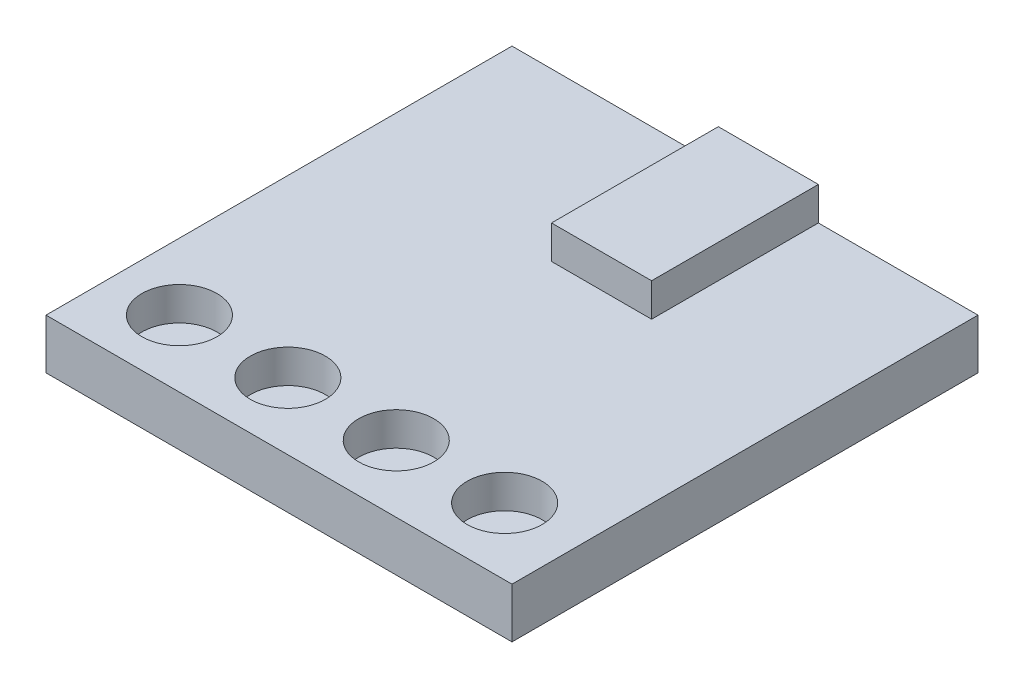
ISO-10303-21;
HEADER;
FILE_DESCRIPTION(('STEP AP214'),'2;1');
FILE_NAME('part.step','',(''),(''),'','','');
FILE_SCHEMA(('AUTOMOTIVE_DESIGN { 1 0 10303 214 1 1 1 1 }'));
ENDSEC;
DATA;
#1=APPLICATION_CONTEXT('core data for automotive mechanical design processes');
#2=APPLICATION_PROTOCOL_DEFINITION('international standard','automotive_design',2000,#1);
#3=PRODUCT_CONTEXT('',#1,'mechanical');
#4=PRODUCT('Part','Part','',(#3));
#5=PRODUCT_RELATED_PRODUCT_CATEGORY('part','',(#4));
#6=PRODUCT_DEFINITION_FORMATION('','',#4);
#7=PRODUCT_DEFINITION_CONTEXT('part definition',#1,'design');
#8=PRODUCT_DEFINITION('design','',#6,#7);
#9=PRODUCT_DEFINITION_SHAPE('','',#8);
#10=(LENGTH_UNIT() NAMED_UNIT(*) SI_UNIT(.MILLI.,.METRE.));
#11=(NAMED_UNIT(*) PLANE_ANGLE_UNIT() SI_UNIT($,.RADIAN.));
#12=(NAMED_UNIT(*) SI_UNIT($,.STERADIAN.) SOLID_ANGLE_UNIT());
#13=UNCERTAINTY_MEASURE_WITH_UNIT(LENGTH_MEASURE(1.E-05),#10,'distance_accuracy_value','');
#14=(GEOMETRIC_REPRESENTATION_CONTEXT(3) GLOBAL_UNCERTAINTY_ASSIGNED_CONTEXT((#13)) GLOBAL_UNIT_ASSIGNED_CONTEXT((#10,
#11,#12)) REPRESENTATION_CONTEXT('',''));
#15=CARTESIAN_POINT('',(0.,0.,0.));
#16=DIRECTION('',(0.,0.,1.));
#17=DIRECTION('',(1.,0.,0.));
#18=AXIS2_PLACEMENT_3D('',#15,#16,#17);
#19=CARTESIAN_POINT('',(0.,1.5,0.));
#20=DIRECTION('',(0.,-1.,0.));
#21=DIRECTION('',(0.,0.,-1.));
#22=AXIS2_PLACEMENT_3D('',#19,#20,#21);
#23=PLANE('',#22);
#24=CARTESIAN_POINT('',(11.75,1.5,-2.));
#25=DIRECTION('',(0.,1.,0.));
#26=DIRECTION('',(0.,0.,1.));
#27=AXIS2_PLACEMENT_3D('',#24,#25,#26);
#28=CIRCLE('',#27,1.125);
#29=CARTESIAN_POINT('',(11.75,1.5,-0.875000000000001));
#30=VERTEX_POINT('',#29);
#31=EDGE_CURVE('E127',#30,#30,#28,.T.);
#32=ORIENTED_EDGE('',*,*,#31,.F.);
#33=EDGE_LOOP('',(#32));
#34=FACE_BOUND('',#33,.T.);
#35=CARTESIAN_POINT('',(8.5,1.5,-2.));
#36=DIRECTION('',(0.,1.,0.));
#37=DIRECTION('',(0.,0.,1.));
#38=AXIS2_PLACEMENT_3D('',#35,#36,#37);
#39=CIRCLE('',#38,1.125);
#40=CARTESIAN_POINT('',(8.5,1.5,-0.875000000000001));
#41=VERTEX_POINT('',#40);
#42=EDGE_CURVE('E146',#41,#41,#39,.T.);
#43=ORIENTED_EDGE('',*,*,#42,.F.);
#44=EDGE_LOOP('',(#43));
#45=FACE_BOUND('',#44,.T.);
#46=CARTESIAN_POINT('',(5.25,1.5,-2.));
#47=DIRECTION('',(0.,1.,0.));
#48=DIRECTION('',(0.,0.,1.));
#49=AXIS2_PLACEMENT_3D('',#46,#47,#48);
#50=CIRCLE('',#49,1.125);
#51=CARTESIAN_POINT('',(5.25,1.5,-0.875));
#52=VERTEX_POINT('',#51);
#53=EDGE_CURVE('E140',#52,#52,#50,.T.);
#54=ORIENTED_EDGE('',*,*,#53,.F.);
#55=EDGE_LOOP('',(#54));
#56=FACE_BOUND('',#55,.T.);
#57=CARTESIAN_POINT('',(2.,1.5,-2.));
#58=DIRECTION('',(0.,1.,0.));
#59=DIRECTION('',(0.,0.,1.));
#60=AXIS2_PLACEMENT_3D('',#57,#58,#59);
#61=CIRCLE('',#60,1.125);
#62=CARTESIAN_POINT('',(2.,1.5,-0.875));
#63=VERTEX_POINT('',#62);
#64=EDGE_CURVE('E137',#63,#63,#61,.T.);
#65=ORIENTED_EDGE('',*,*,#64,.F.);
#66=EDGE_LOOP('',(#65));
#67=FACE_BOUND('',#66,.T.);
#68=DIRECTION('',(0.,0.,-1.));
#69=VECTOR('',#68,1.);
#70=CARTESIAN_POINT('',(9.18465593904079,1.5,-13.97));
#71=LINE('',#70,#69);
#72=CARTESIAN_POINT('',(9.18465593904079,1.5,-8.97));
#73=VERTEX_POINT('',#72);
#74=CARTESIAN_POINT('',(9.18465593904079,1.5,-13.97));
#75=VERTEX_POINT('',#74);
#76=EDGE_CURVE('E52',#73,#75,#71,.T.);
#77=ORIENTED_EDGE('',*,*,#76,.F.);
#78=DIRECTION('',(1.,0.,0.));
#79=VECTOR('',#78,1.);
#80=CARTESIAN_POINT('',(9.18465593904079,1.5,-8.97));
#81=LINE('',#80,#79);
#82=CARTESIAN_POINT('',(6.18465593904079,1.5,-8.97));
#83=VERTEX_POINT('',#82);
#84=EDGE_CURVE('E121',#83,#73,#81,.T.);
#85=ORIENTED_EDGE('',*,*,#84,.F.);
#86=DIRECTION('',(0.,0.,1.));
#87=VECTOR('',#86,1.);
#88=CARTESIAN_POINT('',(6.18465593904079,1.5,-8.97));
#89=LINE('',#88,#87);
#90=CARTESIAN_POINT('',(6.18465593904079,1.5,-13.97));
#91=VERTEX_POINT('',#90);
#92=EDGE_CURVE('E58',#91,#83,#89,.T.);
#93=ORIENTED_EDGE('',*,*,#92,.F.);
#94=DIRECTION('',(-1.,0.,0.));
#95=VECTOR('',#94,1.);
#96=CARTESIAN_POINT('',(0.,1.5,-13.97));
#97=LINE('',#96,#95);
#98=CARTESIAN_POINT('',(0.,1.5,-13.97));
#99=VERTEX_POINT('',#98);
#100=EDGE_CURVE('E162',#91,#99,#97,.T.);
#101=ORIENTED_EDGE('',*,*,#100,.T.);
#102=DIRECTION('',(0.,0.,1.));
#103=VECTOR('',#102,1.);
#104=CARTESIAN_POINT('',(0.,1.5,0.));
#105=LINE('',#104,#103);
#106=CARTESIAN_POINT('',(0.,1.5,0.));
#107=VERTEX_POINT('',#106);
#108=EDGE_CURVE('E154',#99,#107,#105,.T.);
#109=ORIENTED_EDGE('',*,*,#108,.T.);
#110=DIRECTION('',(1.,0.,0.));
#111=VECTOR('',#110,1.);
#112=CARTESIAN_POINT('',(0.,1.5,0.));
#113=LINE('',#112,#111);
#114=CARTESIAN_POINT('',(13.97,1.5,0.));
#115=VERTEX_POINT('',#114);
#116=EDGE_CURVE('E157',#107,#115,#113,.T.);
#117=ORIENTED_EDGE('',*,*,#116,.T.);
#118=DIRECTION('',(0.,0.,-1.));
#119=VECTOR('',#118,1.);
#120=CARTESIAN_POINT('',(13.97,1.5,0.));
#121=LINE('',#120,#119);
#122=CARTESIAN_POINT('',(13.97,1.5,-13.97));
#123=VERTEX_POINT('',#122);
#124=EDGE_CURVE('E160',#115,#123,#121,.T.);
#125=ORIENTED_EDGE('',*,*,#124,.T.);
#126=EDGE_CURVE('E163',#123,#75,#97,.T.);
#127=ORIENTED_EDGE('',*,*,#126,.T.);
#128=EDGE_LOOP('',(#77,#85,#93,#101,#109,#117,#125,#127));
#129=FACE_BOUND('',#128,.T.);
#130=ADVANCED_FACE('F37',(#34,#45,#56,#67,#129),#23,.F.);
#131=CARTESIAN_POINT('',(0.,1.5,0.));
#132=DIRECTION('',(1.,0.,0.));
#133=DIRECTION('',(0.,0.,-1.));
#134=AXIS2_PLACEMENT_3D('',#131,#132,#133);
#135=PLANE('',#134);
#136=DIRECTION('',(0.,0.,1.));
#137=VECTOR('',#136,1.);
#138=CARTESIAN_POINT('',(0.,0.,0.));
#139=LINE('',#138,#137);
#140=CARTESIAN_POINT('',(0.,0.,-13.97));
#141=VERTEX_POINT('',#140);
#142=CARTESIAN_POINT('',(0.,0.,0.));
#143=VERTEX_POINT('',#142);
#144=EDGE_CURVE('E136',#141,#143,#139,.T.);
#145=ORIENTED_EDGE('',*,*,#144,.T.);
#146=DIRECTION('',(0.,-1.,0.));
#147=VECTOR('',#146,1.);
#148=CARTESIAN_POINT('',(0.,1.5,0.));
#149=LINE('',#148,#147);
#150=EDGE_CURVE('E11',#107,#143,#149,.T.);
#151=ORIENTED_EDGE('',*,*,#150,.F.);
#152=ORIENTED_EDGE('',*,*,#108,.F.);
#153=DIRECTION('',(0.,-1.,0.));
#154=VECTOR('',#153,1.);
#155=CARTESIAN_POINT('',(0.,1.5,-13.97));
#156=LINE('',#155,#154);
#157=EDGE_CURVE('E165',#99,#141,#156,.T.);
#158=ORIENTED_EDGE('',*,*,#157,.T.);
#159=EDGE_LOOP('',(#145,#151,#152,#158));
#160=FACE_BOUND('',#159,.T.);
#161=ADVANCED_FACE('F39',(#160),#135,.F.);
#162=CARTESIAN_POINT('',(0.,1.5,0.));
#163=DIRECTION('',(0.,0.,-1.));
#164=DIRECTION('',(-1.,0.,0.));
#165=AXIS2_PLACEMENT_3D('',#162,#163,#164);
#166=PLANE('',#165);
#167=DIRECTION('',(1.,0.,0.));
#168=VECTOR('',#167,1.);
#169=CARTESIAN_POINT('',(0.,0.,0.));
#170=LINE('',#169,#168);
#171=CARTESIAN_POINT('',(13.97,0.,0.));
#172=VERTEX_POINT('',#171);
#173=EDGE_CURVE('E168',#143,#172,#170,.T.);
#174=ORIENTED_EDGE('',*,*,#173,.T.);
#175=DIRECTION('',(0.,-1.,0.));
#176=VECTOR('',#175,1.);
#177=CARTESIAN_POINT('',(13.97,1.5,0.));
#178=LINE('',#177,#176);
#179=EDGE_CURVE('E45',#115,#172,#178,.T.);
#180=ORIENTED_EDGE('',*,*,#179,.F.);
#181=ORIENTED_EDGE('',*,*,#116,.F.);
#182=ORIENTED_EDGE('',*,*,#150,.T.);
#183=EDGE_LOOP('',(#174,#180,#181,#182));
#184=FACE_BOUND('',#183,.T.);
#185=ADVANCED_FACE('F220',(#184),#166,.F.);
#186=CARTESIAN_POINT('',(13.97,1.5,0.));
#187=DIRECTION('',(-1.,0.,0.));
#188=DIRECTION('',(0.,0.,1.));
#189=AXIS2_PLACEMENT_3D('',#186,#187,#188);
#190=PLANE('',#189);
#191=DIRECTION('',(0.,0.,-1.));
#192=VECTOR('',#191,1.);
#193=CARTESIAN_POINT('',(13.97,0.,0.));
#194=LINE('',#193,#192);
#195=CARTESIAN_POINT('',(13.97,0.,-13.97));
#196=VERTEX_POINT('',#195);
#197=EDGE_CURVE('E170',#172,#196,#194,.T.);
#198=ORIENTED_EDGE('',*,*,#197,.T.);
#199=DIRECTION('',(0.,-1.,0.));
#200=VECTOR('',#199,1.);
#201=CARTESIAN_POINT('',(13.97,1.5,-13.97));
#202=LINE('',#201,#200);
#203=EDGE_CURVE('E175',#123,#196,#202,.T.);
#204=ORIENTED_EDGE('',*,*,#203,.F.);
#205=ORIENTED_EDGE('',*,*,#124,.F.);
#206=ORIENTED_EDGE('',*,*,#179,.T.);
#207=EDGE_LOOP('',(#198,#204,#205,#206));
#208=FACE_BOUND('',#207,.T.);
#209=ADVANCED_FACE('F182',(#208),#190,.F.);
#210=CARTESIAN_POINT('',(0.,1.5,-13.97));
#211=DIRECTION('',(0.,0.,1.));
#212=DIRECTION('',(1.,0.,0.));
#213=AXIS2_PLACEMENT_3D('',#210,#211,#212);
#214=PLANE('',#213);
#215=DIRECTION('',(-1.,0.,0.));
#216=VECTOR('',#215,1.);
#217=CARTESIAN_POINT('',(0.,0.,-13.97));
#218=LINE('',#217,#216);
#219=EDGE_CURVE('E158',#196,#141,#218,.T.);
#220=ORIENTED_EDGE('',*,*,#219,.T.);
#221=ORIENTED_EDGE('',*,*,#157,.F.);
#222=ORIENTED_EDGE('',*,*,#100,.F.);
#223=DIRECTION('',(0.,-1.,0.));
#224=VECTOR('',#223,1.);
#225=CARTESIAN_POINT('',(6.18465593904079,2.5,-13.97));
#226=LINE('',#225,#224);
#227=CARTESIAN_POINT('',(6.18465593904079,2.5,-13.97));
#228=VERTEX_POINT('',#227);
#229=EDGE_CURVE('E108',#228,#91,#226,.T.);
#230=ORIENTED_EDGE('',*,*,#229,.F.);
#231=DIRECTION('',(-1.,0.,0.));
#232=VECTOR('',#231,1.);
#233=CARTESIAN_POINT('',(6.18465593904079,2.5,-13.97));
#234=LINE('',#233,#232);
#235=CARTESIAN_POINT('',(9.18465593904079,2.5,-13.97));
#236=VERTEX_POINT('',#235);
#237=EDGE_CURVE('E101',#236,#228,#234,.T.);
#238=ORIENTED_EDGE('',*,*,#237,.F.);
#239=DIRECTION('',(0.,-1.,0.));
#240=VECTOR('',#239,1.);
#241=CARTESIAN_POINT('',(9.18465593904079,2.5,-13.97));
#242=LINE('',#241,#240);
#243=EDGE_CURVE('E106',#236,#75,#242,.T.);
#244=ORIENTED_EDGE('',*,*,#243,.T.);
#245=ORIENTED_EDGE('',*,*,#126,.F.);
#246=ORIENTED_EDGE('',*,*,#203,.T.);
#247=EDGE_LOOP('',(#220,#221,#222,#230,#238,#244,#245,#246));
#248=FACE_BOUND('',#247,.T.);
#249=ADVANCED_FACE('F103',(#248),#214,.F.);
#250=CARTESIAN_POINT('',(0.,0.,0.));
#251=DIRECTION('',(0.,-1.,0.));
#252=DIRECTION('',(0.,0.,-1.));
#253=AXIS2_PLACEMENT_3D('',#250,#251,#252);
#254=PLANE('',#253);
#255=ORIENTED_EDGE('',*,*,#144,.F.);
#256=ORIENTED_EDGE('',*,*,#219,.F.);
#257=ORIENTED_EDGE('',*,*,#197,.F.);
#258=ORIENTED_EDGE('',*,*,#173,.F.);
#259=EDGE_LOOP('',(#255,#256,#257,#258));
#260=FACE_BOUND('',#259,.T.);
#261=ADVANCED_FACE('F188',(#260),#254,.T.);
#262=CARTESIAN_POINT('',(11.75,0.5,-2.));
#263=DIRECTION('',(0.,1.,0.));
#264=DIRECTION('',(0.,0.,1.));
#265=AXIS2_PLACEMENT_3D('',#262,#263,#264);
#266=CYLINDRICAL_SURFACE('',#265,1.125);
#267=CARTESIAN_POINT('',(11.75,0.5,-2.));
#268=DIRECTION('',(0.,1.,0.));
#269=DIRECTION('',(0.,0.,1.));
#270=AXIS2_PLACEMENT_3D('',#267,#268,#269);
#271=CIRCLE('',#270,1.125);
#272=CARTESIAN_POINT('',(11.75,0.5,-0.875000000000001));
#273=VERTEX_POINT('',#272);
#274=EDGE_CURVE('E124',#273,#273,#271,.T.);
#275=ORIENTED_EDGE('',*,*,#274,.F.);
#276=EDGE_LOOP('',(#275));
#277=FACE_BOUND('',#276,.T.);
#278=ORIENTED_EDGE('',*,*,#31,.T.);
#279=EDGE_LOOP('',(#278));
#280=FACE_BOUND('',#279,.T.);
#281=ADVANCED_FACE('F229',(#277,#280),#266,.F.);
#282=CARTESIAN_POINT('',(11.75,0.5,-2.));
#283=DIRECTION('',(0.,1.,0.));
#284=DIRECTION('',(0.,0.,1.));
#285=AXIS2_PLACEMENT_3D('',#282,#283,#284);
#286=PLANE('',#285);
#287=ORIENTED_EDGE('',*,*,#274,.T.);
#288=EDGE_LOOP('',(#287));
#289=FACE_BOUND('',#288,.T.);
#290=ADVANCED_FACE('F225',(#289),#286,.T.);
#291=CARTESIAN_POINT('',(8.5,0.5,-2.));
#292=DIRECTION('',(0.,1.,0.));
#293=DIRECTION('',(0.,0.,1.));
#294=AXIS2_PLACEMENT_3D('',#291,#292,#293);
#295=CYLINDRICAL_SURFACE('',#294,1.125);
#296=CARTESIAN_POINT('',(8.5,0.5,-2.));
#297=DIRECTION('',(0.,1.,0.));
#298=DIRECTION('',(0.,0.,1.));
#299=AXIS2_PLACEMENT_3D('',#296,#297,#298);
#300=CIRCLE('',#299,1.125);
#301=CARTESIAN_POINT('',(8.5,0.5,-0.875000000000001));
#302=VERTEX_POINT('',#301);
#303=EDGE_CURVE('E149',#302,#302,#300,.T.);
#304=ORIENTED_EDGE('',*,*,#303,.F.);
#305=EDGE_LOOP('',(#304));
#306=FACE_BOUND('',#305,.T.);
#307=ORIENTED_EDGE('',*,*,#42,.T.);
#308=EDGE_LOOP('',(#307));
#309=FACE_BOUND('',#308,.T.);
#310=ADVANCED_FACE('F263',(#306,#309),#295,.F.);
#311=CARTESIAN_POINT('',(8.5,0.5,-2.));
#312=DIRECTION('',(0.,1.,0.));
#313=DIRECTION('',(0.,0.,1.));
#314=AXIS2_PLACEMENT_3D('',#311,#312,#313);
#315=PLANE('',#314);
#316=ORIENTED_EDGE('',*,*,#303,.T.);
#317=EDGE_LOOP('',(#316));
#318=FACE_BOUND('',#317,.T.);
#319=ADVANCED_FACE('F270',(#318),#315,.T.);
#320=CARTESIAN_POINT('',(5.25,0.5,-2.));
#321=DIRECTION('',(0.,1.,0.));
#322=DIRECTION('',(0.,0.,1.));
#323=AXIS2_PLACEMENT_3D('',#320,#321,#322);
#324=CYLINDRICAL_SURFACE('',#323,1.125);
#325=CARTESIAN_POINT('',(5.25,0.5,-2.));
#326=DIRECTION('',(0.,1.,0.));
#327=DIRECTION('',(0.,0.,1.));
#328=AXIS2_PLACEMENT_3D('',#325,#326,#327);
#329=CIRCLE('',#328,1.125);
#330=CARTESIAN_POINT('',(5.25,0.5,-0.875));
#331=VERTEX_POINT('',#330);
#332=EDGE_CURVE('E143',#331,#331,#329,.T.);
#333=ORIENTED_EDGE('',*,*,#332,.F.);
#334=EDGE_LOOP('',(#333));
#335=FACE_BOUND('',#334,.T.);
#336=ORIENTED_EDGE('',*,*,#53,.T.);
#337=EDGE_LOOP('',(#336));
#338=FACE_BOUND('',#337,.T.);
#339=ADVANCED_FACE('F278',(#335,#338),#324,.F.);
#340=CARTESIAN_POINT('',(5.25,0.5,-2.));
#341=DIRECTION('',(0.,1.,0.));
#342=DIRECTION('',(0.,0.,1.));
#343=AXIS2_PLACEMENT_3D('',#340,#341,#342);
#344=PLANE('',#343);
#345=ORIENTED_EDGE('',*,*,#332,.T.);
#346=EDGE_LOOP('',(#345));
#347=FACE_BOUND('',#346,.T.);
#348=ADVANCED_FACE('F286',(#347),#344,.T.);
#349=CARTESIAN_POINT('',(2.,0.5,-2.));
#350=DIRECTION('',(0.,1.,0.));
#351=DIRECTION('',(0.,0.,1.));
#352=AXIS2_PLACEMENT_3D('',#349,#350,#351);
#353=CYLINDRICAL_SURFACE('',#352,1.125);
#354=CARTESIAN_POINT('',(2.,0.5,-2.));
#355=DIRECTION('',(0.,1.,0.));
#356=DIRECTION('',(0.,0.,1.));
#357=AXIS2_PLACEMENT_3D('',#354,#355,#356);
#358=CIRCLE('',#357,1.125);
#359=CARTESIAN_POINT('',(2.,0.5,-0.875));
#360=VERTEX_POINT('',#359);
#361=EDGE_CURVE('E133',#360,#360,#358,.T.);
#362=ORIENTED_EDGE('',*,*,#361,.F.);
#363=EDGE_LOOP('',(#362));
#364=FACE_BOUND('',#363,.T.);
#365=ORIENTED_EDGE('',*,*,#64,.T.);
#366=EDGE_LOOP('',(#365));
#367=FACE_BOUND('',#366,.T.);
#368=ADVANCED_FACE('F294',(#364,#367),#353,.F.);
#369=CARTESIAN_POINT('',(2.,0.5,-2.));
#370=DIRECTION('',(0.,1.,0.));
#371=DIRECTION('',(0.,0.,1.));
#372=AXIS2_PLACEMENT_3D('',#369,#370,#371);
#373=PLANE('',#372);
#374=ORIENTED_EDGE('',*,*,#361,.T.);
#375=EDGE_LOOP('',(#374));
#376=FACE_BOUND('',#375,.T.);
#377=ADVANCED_FACE('F302',(#376),#373,.T.);
#378=CARTESIAN_POINT('',(9.18465593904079,2.5,-13.97));
#379=DIRECTION('',(-1.,0.,0.));
#380=DIRECTION('',(0.,0.,1.));
#381=AXIS2_PLACEMENT_3D('',#378,#379,#380);
#382=PLANE('',#381);
#383=ORIENTED_EDGE('',*,*,#76,.T.);
#384=ORIENTED_EDGE('',*,*,#243,.F.);
#385=DIRECTION('',(0.,0.,-1.));
#386=VECTOR('',#385,1.);
#387=CARTESIAN_POINT('',(9.18465593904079,2.5,-13.97));
#388=LINE('',#387,#386);
#389=CARTESIAN_POINT('',(9.18465593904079,2.5,-8.97));
#390=VERTEX_POINT('',#389);
#391=EDGE_CURVE('E112',#390,#236,#388,.T.);
#392=ORIENTED_EDGE('',*,*,#391,.F.);
#393=DIRECTION('',(0.,-1.,0.));
#394=VECTOR('',#393,1.);
#395=CARTESIAN_POINT('',(9.18465593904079,2.5,-8.97));
#396=LINE('',#395,#394);
#397=EDGE_CURVE('E198',#390,#73,#396,.T.);
#398=ORIENTED_EDGE('',*,*,#397,.T.);
#399=EDGE_LOOP('',(#383,#384,#392,#398));
#400=FACE_BOUND('',#399,.T.);
#401=ADVANCED_FACE('F123',(#400),#382,.F.);
#402=CARTESIAN_POINT('',(6.18465593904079,2.5,-8.97));
#403=DIRECTION('',(1.,0.,0.));
#404=DIRECTION('',(0.,0.,-1.));
#405=AXIS2_PLACEMENT_3D('',#402,#403,#404);
#406=PLANE('',#405);
#407=ORIENTED_EDGE('',*,*,#92,.T.);
#408=DIRECTION('',(0.,-1.,0.));
#409=VECTOR('',#408,1.);
#410=CARTESIAN_POINT('',(6.18465593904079,2.5,-8.97));
#411=LINE('',#410,#409);
#412=CARTESIAN_POINT('',(6.18465593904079,2.5,-8.97));
#413=VERTEX_POINT('',#412);
#414=EDGE_CURVE('E129',#413,#83,#411,.T.);
#415=ORIENTED_EDGE('',*,*,#414,.F.);
#416=DIRECTION('',(0.,0.,1.));
#417=VECTOR('',#416,1.);
#418=CARTESIAN_POINT('',(6.18465593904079,2.5,-8.97));
#419=LINE('',#418,#417);
#420=EDGE_CURVE('E111',#228,#413,#419,.T.);
#421=ORIENTED_EDGE('',*,*,#420,.F.);
#422=ORIENTED_EDGE('',*,*,#229,.T.);
#423=EDGE_LOOP('',(#407,#415,#421,#422));
#424=FACE_BOUND('',#423,.T.);
#425=ADVANCED_FACE('F194',(#424),#406,.F.);
#426=CARTESIAN_POINT('',(9.18465593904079,2.5,-8.97));
#427=DIRECTION('',(0.,0.,-1.));
#428=DIRECTION('',(-1.,0.,0.));
#429=AXIS2_PLACEMENT_3D('',#426,#427,#428);
#430=PLANE('',#429);
#431=ORIENTED_EDGE('',*,*,#84,.T.);
#432=ORIENTED_EDGE('',*,*,#397,.F.);
#433=DIRECTION('',(1.,0.,0.));
#434=VECTOR('',#433,1.);
#435=CARTESIAN_POINT('',(9.18465593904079,2.5,-8.97));
#436=LINE('',#435,#434);
#437=EDGE_CURVE('E117',#413,#390,#436,.T.);
#438=ORIENTED_EDGE('',*,*,#437,.F.);
#439=ORIENTED_EDGE('',*,*,#414,.T.);
#440=EDGE_LOOP('',(#431,#432,#438,#439));
#441=FACE_BOUND('',#440,.T.);
#442=ADVANCED_FACE('F205',(#441),#430,.F.);
#443=CARTESIAN_POINT('',(0.,2.5,0.));
#444=DIRECTION('',(0.,-1.,0.));
#445=DIRECTION('',(0.,0.,-1.));
#446=AXIS2_PLACEMENT_3D('',#443,#444,#445);
#447=PLANE('',#446);
#448=ORIENTED_EDGE('',*,*,#391,.T.);
#449=ORIENTED_EDGE('',*,*,#237,.T.);
#450=ORIENTED_EDGE('',*,*,#420,.T.);
#451=ORIENTED_EDGE('',*,*,#437,.T.);
#452=EDGE_LOOP('',(#448,#449,#450,#451));
#453=FACE_BOUND('',#452,.T.);
#454=ADVANCED_FACE('F115',(#453),#447,.F.);
#455=CLOSED_SHELL('',(#130,#161,#185,#209,#249,#261,#281,#290,#310,#319,#339,#348,#368,#377,
#401,#425,#442,#454));
#456=MANIFOLD_SOLID_BREP('B2',#455);
#457=ADVANCED_BREP_SHAPE_REPRESENTATION('',(#18,#456),#14);
#458=SHAPE_DEFINITION_REPRESENTATION(#9,#457);
ENDSEC;
END-ISO-10303-21;
